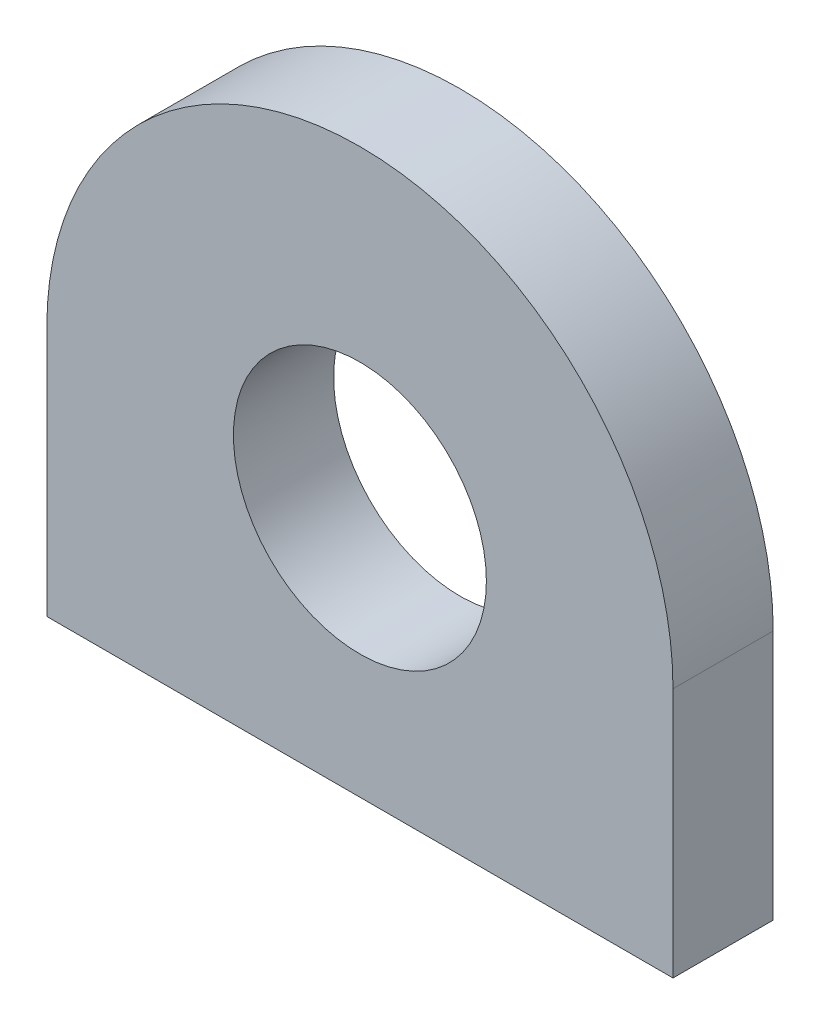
ISO-10303-21;
HEADER;
FILE_DESCRIPTION(('STEP AP214'),'2;1');
FILE_NAME('part.step','',(''),(''),'','','');
FILE_SCHEMA(('AUTOMOTIVE_DESIGN { 1 0 10303 214 1 1 1 1 }'));
ENDSEC;
DATA;
#1=APPLICATION_CONTEXT('core data for automotive mechanical design processes');
#2=APPLICATION_PROTOCOL_DEFINITION('international standard','automotive_design',2000,#1);
#3=PRODUCT_CONTEXT('',#1,'mechanical');
#4=PRODUCT('Part','Part','',(#3));
#5=PRODUCT_RELATED_PRODUCT_CATEGORY('part','',(#4));
#6=PRODUCT_DEFINITION_FORMATION('','',#4);
#7=PRODUCT_DEFINITION_CONTEXT('part definition',#1,'design');
#8=PRODUCT_DEFINITION('design','',#6,#7);
#9=PRODUCT_DEFINITION_SHAPE('','',#8);
#10=(LENGTH_UNIT() NAMED_UNIT(*) SI_UNIT(.MILLI.,.METRE.));
#11=(NAMED_UNIT(*) PLANE_ANGLE_UNIT() SI_UNIT($,.RADIAN.));
#12=(NAMED_UNIT(*) SI_UNIT($,.STERADIAN.) SOLID_ANGLE_UNIT());
#13=UNCERTAINTY_MEASURE_WITH_UNIT(LENGTH_MEASURE(1.E-05),#10,'distance_accuracy_value','');
#14=(GEOMETRIC_REPRESENTATION_CONTEXT(3) GLOBAL_UNCERTAINTY_ASSIGNED_CONTEXT((#13)) GLOBAL_UNIT_ASSIGNED_CONTEXT((#10,
#11,#12)) REPRESENTATION_CONTEXT('',''));
#15=CARTESIAN_POINT('',(0.,0.,0.));
#16=DIRECTION('',(0.,0.,1.));
#17=DIRECTION('',(1.,0.,0.));
#18=AXIS2_PLACEMENT_3D('',#15,#16,#17);
#19=CARTESIAN_POINT('',(0.,0.,8.));
#20=DIRECTION('',(0.,0.,1.));
#21=DIRECTION('',(1.,0.,0.));
#22=AXIS2_PLACEMENT_3D('',#19,#20,#21);
#23=PLANE('',#22);
#24=DIRECTION('',(0.,-1.,0.));
#25=VECTOR('',#24,1.);
#26=CARTESIAN_POINT('',(-25.,0.,8.));
#27=LINE('',#26,#25);
#28=CARTESIAN_POINT('',(-25.,0.,8.));
#29=VERTEX_POINT('',#28);
#30=CARTESIAN_POINT('',(-25.,-20.,8.));
#31=VERTEX_POINT('',#30);
#32=EDGE_CURVE('E99',#29,#31,#27,.T.);
#33=ORIENTED_EDGE('',*,*,#32,.T.);
#34=DIRECTION('',(1.,0.,0.));
#35=VECTOR('',#34,1.);
#36=CARTESIAN_POINT('',(-25.,-20.,8.));
#37=LINE('',#36,#35);
#38=CARTESIAN_POINT('',(25.,-20.,8.));
#39=VERTEX_POINT('',#38);
#40=EDGE_CURVE('E84',#31,#39,#37,.T.);
#41=ORIENTED_EDGE('',*,*,#40,.T.);
#42=DIRECTION('',(0.,1.,0.));
#43=VECTOR('',#42,1.);
#44=CARTESIAN_POINT('',(25.,-20.,8.));
#45=LINE('',#44,#43);
#46=CARTESIAN_POINT('',(25.,0.,8.));
#47=VERTEX_POINT('',#46);
#48=EDGE_CURVE('E50',#39,#47,#45,.T.);
#49=ORIENTED_EDGE('',*,*,#48,.T.);
#50=CARTESIAN_POINT('',(0.,0.,8.));
#51=DIRECTION('',(0.,0.,1.));
#52=DIRECTION('',(1.,0.,0.));
#53=AXIS2_PLACEMENT_3D('',#50,#51,#52);
#54=CIRCLE('',#53,25.);
#55=EDGE_CURVE('E45',#47,#29,#54,.T.);
#56=ORIENTED_EDGE('',*,*,#55,.T.);
#57=EDGE_LOOP('',(#33,#41,#49,#56));
#58=FACE_BOUND('',#57,.T.);
#59=CARTESIAN_POINT('',(0.,0.,8.));
#60=DIRECTION('',(0.,0.,1.));
#61=DIRECTION('',(1.,0.,0.));
#62=AXIS2_PLACEMENT_3D('',#59,#60,#61);
#63=CIRCLE('',#62,10.1);
#64=CARTESIAN_POINT('',(10.1,0.,8.));
#65=VERTEX_POINT('',#64);
#66=EDGE_CURVE('E89',#65,#65,#63,.T.);
#67=ORIENTED_EDGE('',*,*,#66,.F.);
#68=EDGE_LOOP('',(#67));
#69=FACE_BOUND('',#68,.T.);
#70=ADVANCED_FACE('F30',(#58,#69),#23,.T.);
#71=CARTESIAN_POINT('',(0.,0.,0.));
#72=DIRECTION('',(0.,0.,1.));
#73=DIRECTION('',(1.,0.,0.));
#74=AXIS2_PLACEMENT_3D('',#71,#72,#73);
#75=PLANE('',#74);
#76=DIRECTION('',(0.,-1.,0.));
#77=VECTOR('',#76,1.);
#78=CARTESIAN_POINT('',(-25.,0.,0.));
#79=LINE('',#78,#77);
#80=CARTESIAN_POINT('',(-25.,0.,0.));
#81=VERTEX_POINT('',#80);
#82=CARTESIAN_POINT('',(-25.,-20.,0.));
#83=VERTEX_POINT('',#82);
#84=EDGE_CURVE('E76',#81,#83,#79,.T.);
#85=ORIENTED_EDGE('',*,*,#84,.F.);
#86=CARTESIAN_POINT('',(0.,0.,0.));
#87=DIRECTION('',(0.,0.,1.));
#88=DIRECTION('',(1.,0.,0.));
#89=AXIS2_PLACEMENT_3D('',#86,#87,#88);
#90=CIRCLE('',#89,25.);
#91=CARTESIAN_POINT('',(25.,0.,0.));
#92=VERTEX_POINT('',#91);
#93=EDGE_CURVE('E97',#92,#81,#90,.T.);
#94=ORIENTED_EDGE('',*,*,#93,.F.);
#95=DIRECTION('',(0.,1.,0.));
#96=VECTOR('',#95,1.);
#97=CARTESIAN_POINT('',(25.,-20.,0.));
#98=LINE('',#97,#96);
#99=CARTESIAN_POINT('',(25.,-20.,0.));
#100=VERTEX_POINT('',#99);
#101=EDGE_CURVE('E77',#100,#92,#98,.T.);
#102=ORIENTED_EDGE('',*,*,#101,.F.);
#103=DIRECTION('',(1.,0.,0.));
#104=VECTOR('',#103,1.);
#105=CARTESIAN_POINT('',(-25.,-20.,0.));
#106=LINE('',#105,#104);
#107=EDGE_CURVE('E71',#83,#100,#106,.T.);
#108=ORIENTED_EDGE('',*,*,#107,.F.);
#109=EDGE_LOOP('',(#85,#94,#102,#108));
#110=FACE_BOUND('',#109,.T.);
#111=CARTESIAN_POINT('',(0.,0.,0.));
#112=DIRECTION('',(0.,0.,1.));
#113=DIRECTION('',(1.,0.,0.));
#114=AXIS2_PLACEMENT_3D('',#111,#112,#113);
#115=CIRCLE('',#114,10.1);
#116=CARTESIAN_POINT('',(10.1,0.,0.));
#117=VERTEX_POINT('',#116);
#118=EDGE_CURVE('E92',#117,#117,#115,.T.);
#119=ORIENTED_EDGE('',*,*,#118,.T.);
#120=EDGE_LOOP('',(#119));
#121=FACE_BOUND('',#120,.T.);
#122=ADVANCED_FACE('F72',(#110,#121),#75,.F.);
#123=CARTESIAN_POINT('',(-25.,0.,8.));
#124=DIRECTION('',(1.,0.,0.));
#125=DIRECTION('',(0.,1.,0.));
#126=AXIS2_PLACEMENT_3D('',#123,#124,#125);
#127=PLANE('',#126);
#128=ORIENTED_EDGE('',*,*,#84,.T.);
#129=DIRECTION('',(0.,0.,-1.));
#130=VECTOR('',#129,1.);
#131=CARTESIAN_POINT('',(-25.,-20.,8.));
#132=LINE('',#131,#130);
#133=EDGE_CURVE('E11',#31,#83,#132,.T.);
#134=ORIENTED_EDGE('',*,*,#133,.F.);
#135=ORIENTED_EDGE('',*,*,#32,.F.);
#136=DIRECTION('',(0.,0.,-1.));
#137=VECTOR('',#136,1.);
#138=CARTESIAN_POINT('',(-25.,0.,8.));
#139=LINE('',#138,#137);
#140=EDGE_CURVE('E88',#29,#81,#139,.T.);
#141=ORIENTED_EDGE('',*,*,#140,.T.);
#142=EDGE_LOOP('',(#128,#134,#135,#141));
#143=FACE_BOUND('',#142,.T.);
#144=ADVANCED_FACE('F32',(#143),#127,.F.);
#145=CARTESIAN_POINT('',(-25.,-20.,8.));
#146=DIRECTION('',(0.,1.,0.));
#147=DIRECTION('',(0.,0.,1.));
#148=AXIS2_PLACEMENT_3D('',#145,#146,#147);
#149=PLANE('',#148);
#150=ORIENTED_EDGE('',*,*,#107,.T.);
#151=DIRECTION('',(0.,0.,-1.));
#152=VECTOR('',#151,1.);
#153=CARTESIAN_POINT('',(25.,-20.,8.));
#154=LINE('',#153,#152);
#155=EDGE_CURVE('E38',#39,#100,#154,.T.);
#156=ORIENTED_EDGE('',*,*,#155,.F.);
#157=ORIENTED_EDGE('',*,*,#40,.F.);
#158=ORIENTED_EDGE('',*,*,#133,.T.);
#159=EDGE_LOOP('',(#150,#156,#157,#158));
#160=FACE_BOUND('',#159,.T.);
#161=ADVANCED_FACE('F83',(#160),#149,.F.);
#162=CARTESIAN_POINT('',(25.,-20.,8.));
#163=DIRECTION('',(-1.,0.,0.));
#164=DIRECTION('',(0.,-1.,0.));
#165=AXIS2_PLACEMENT_3D('',#162,#163,#164);
#166=PLANE('',#165);
#167=ORIENTED_EDGE('',*,*,#101,.T.);
#168=DIRECTION('',(0.,0.,-1.));
#169=VECTOR('',#168,1.);
#170=CARTESIAN_POINT('',(25.,0.,8.));
#171=LINE('',#170,#169);
#172=EDGE_CURVE('E105',#47,#92,#171,.T.);
#173=ORIENTED_EDGE('',*,*,#172,.F.);
#174=ORIENTED_EDGE('',*,*,#48,.F.);
#175=ORIENTED_EDGE('',*,*,#155,.T.);
#176=EDGE_LOOP('',(#167,#173,#174,#175));
#177=FACE_BOUND('',#176,.T.);
#178=ADVANCED_FACE('F108',(#177),#166,.F.);
#179=CARTESIAN_POINT('',(0.,0.,8.));
#180=DIRECTION('',(0.,0.,-1.));
#181=DIRECTION('',(-1.,0.,0.));
#182=AXIS2_PLACEMENT_3D('',#179,#180,#181);
#183=CYLINDRICAL_SURFACE('',#182,25.);
#184=ORIENTED_EDGE('',*,*,#93,.T.);
#185=ORIENTED_EDGE('',*,*,#140,.F.);
#186=ORIENTED_EDGE('',*,*,#55,.F.);
#187=ORIENTED_EDGE('',*,*,#172,.T.);
#188=EDGE_LOOP('',(#184,#185,#186,#187));
#189=FACE_BOUND('',#188,.T.);
#190=ADVANCED_FACE('F110',(#189),#183,.T.);
#191=CARTESIAN_POINT('',(0.,0.,8.));
#192=DIRECTION('',(0.,0.,-1.));
#193=DIRECTION('',(-1.,0.,0.));
#194=AXIS2_PLACEMENT_3D('',#191,#192,#193);
#195=CYLINDRICAL_SURFACE('',#194,10.1);
#196=ORIENTED_EDGE('',*,*,#66,.T.);
#197=EDGE_LOOP('',(#196));
#198=FACE_BOUND('',#197,.T.);
#199=ORIENTED_EDGE('',*,*,#118,.F.);
#200=EDGE_LOOP('',(#199));
#201=FACE_BOUND('',#200,.T.);
#202=ADVANCED_FACE('F116',(#198,#201),#195,.F.);
#203=CLOSED_SHELL('',(#70,#122,#144,#161,#178,#190,#202));
#204=MANIFOLD_SOLID_BREP('B2',#203);
#205=ADVANCED_BREP_SHAPE_REPRESENTATION('',(#18,#204),#14);
#206=SHAPE_DEFINITION_REPRESENTATION(#9,#205);
ENDSEC;
END-ISO-10303-21;
